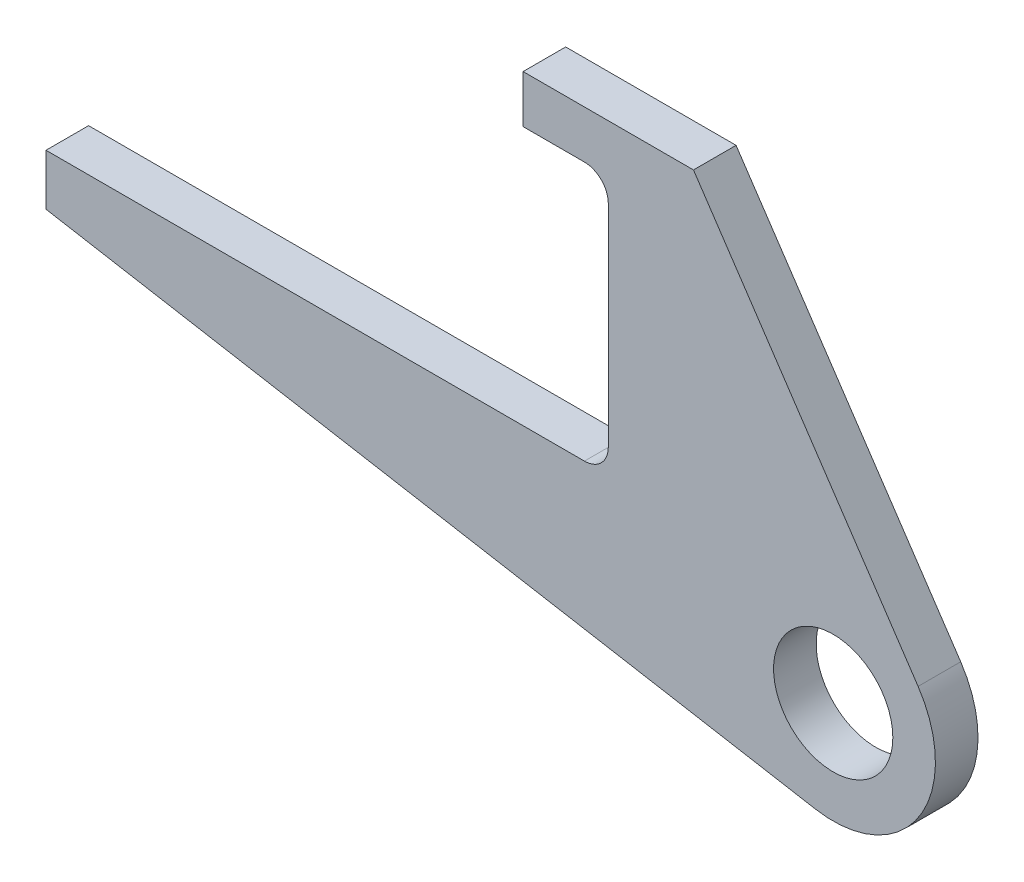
from build123d import *

# Parameters (mm, degrees)
ESQUISSE1_R      = 35
EXTRUSION1_DEPTH = 25


with BuildPart() as part:
    # Esquisse1 → Extrusion1 (new body)
    with BuildSketch(Plane.XY):
        with BuildLine():
            Line((-462, 50), (-146, 50))
            ThreePointArc((-146, 50), (-136.100505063, 54.100505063), (-132, 64))
            Line((-132, 64), (-132, 188))
            ThreePointArc((-132, 188), (-136.100505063, 197.899494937), (-146, 202))
            Line((-146, 202), (-182, 202))
            Line((-182, 202), (-182, 230))
            Line((-182, 230), (-82, 230))
            Line((-82, 230), (49.831875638, 33.41832088))
            ThreePointArc((49.831875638, 33.41832088), (50.295351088, -32.716626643), (-10.350669, -59.100453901))
            Line((-10.350669, -59.100453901), (-462, 20))
            Line((-462, 20), (-462, 50))
        make_face()
        Circle(ESQUISSE1_R, mode=Mode.SUBTRACT)
    extrude(amount=EXTRUSION1_DEPTH)


solid = part.part
